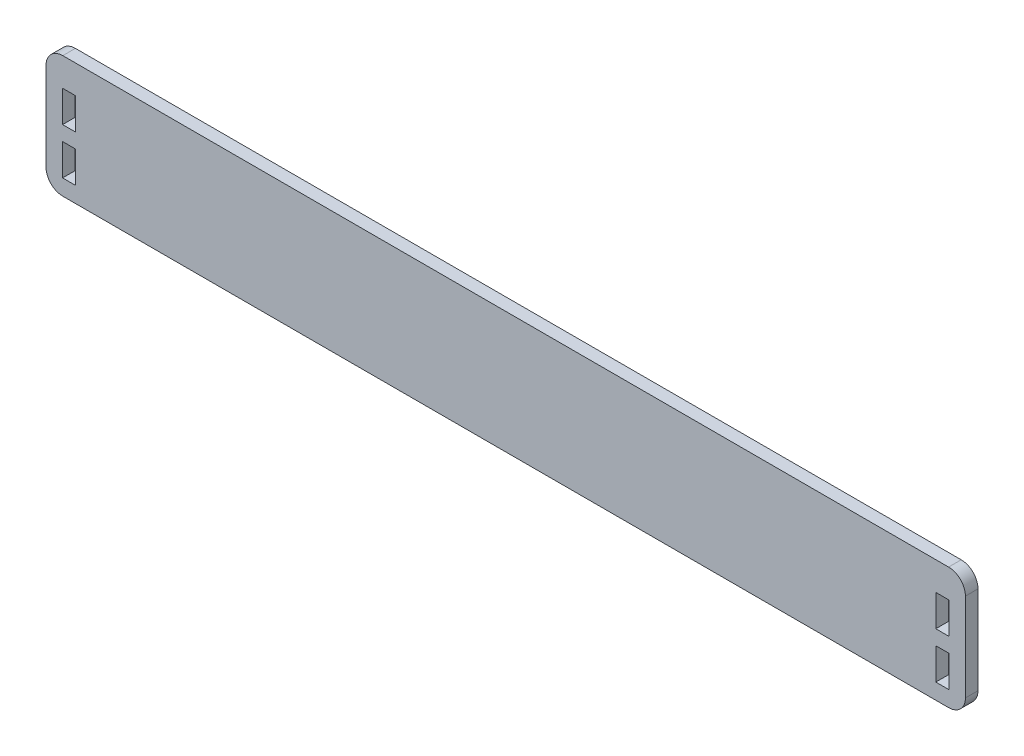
ISO-10303-21;
HEADER;
FILE_DESCRIPTION(('STEP AP214'),'2;1');
FILE_NAME('part.step','',(''),(''),'','','');
FILE_SCHEMA(('AUTOMOTIVE_DESIGN { 1 0 10303 214 1 1 1 1 }'));
ENDSEC;
DATA;
#1=APPLICATION_CONTEXT('core data for automotive mechanical design processes');
#2=APPLICATION_PROTOCOL_DEFINITION('international standard','automotive_design',2000,#1);
#3=PRODUCT_CONTEXT('',#1,'mechanical');
#4=PRODUCT('Part','Part','',(#3));
#5=PRODUCT_RELATED_PRODUCT_CATEGORY('part','',(#4));
#6=PRODUCT_DEFINITION_FORMATION('','',#4);
#7=PRODUCT_DEFINITION_CONTEXT('part definition',#1,'design');
#8=PRODUCT_DEFINITION('design','',#6,#7);
#9=PRODUCT_DEFINITION_SHAPE('','',#8);
#10=(LENGTH_UNIT() NAMED_UNIT(*) SI_UNIT(.MILLI.,.METRE.));
#11=(NAMED_UNIT(*) PLANE_ANGLE_UNIT() SI_UNIT($,.RADIAN.));
#12=(NAMED_UNIT(*) SI_UNIT($,.STERADIAN.) SOLID_ANGLE_UNIT());
#13=UNCERTAINTY_MEASURE_WITH_UNIT(LENGTH_MEASURE(1.E-05),#10,'distance_accuracy_value','');
#14=(GEOMETRIC_REPRESENTATION_CONTEXT(3) GLOBAL_UNCERTAINTY_ASSIGNED_CONTEXT((#13)) GLOBAL_UNIT_ASSIGNED_CONTEXT((#10,
#11,#12)) REPRESENTATION_CONTEXT('',''));
#15=CARTESIAN_POINT('',(0.,0.,0.));
#16=DIRECTION('',(0.,0.,1.));
#17=DIRECTION('',(1.,0.,0.));
#18=AXIS2_PLACEMENT_3D('',#15,#16,#17);
#19=CARTESIAN_POINT('',(-14.,66.0000000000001,6.));
#20=DIRECTION('',(1.,0.,0.));
#21=DIRECTION('',(0.,1.,0.));
#22=AXIS2_PLACEMENT_3D('',#19,#20,#21);
#23=PLANE('',#22);
#24=DIRECTION('',(0.,-1.,0.));
#25=VECTOR('',#24,1.);
#26=CARTESIAN_POINT('',(-14.,66.0000000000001,0.));
#27=LINE('',#26,#25);
#28=CARTESIAN_POINT('',(-14.,58.0000000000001,0.));
#29=VERTEX_POINT('',#28);
#30=CARTESIAN_POINT('',(-14.,16.,0.));
#31=VERTEX_POINT('',#30);
#32=EDGE_CURVE('E330',#29,#31,#27,.T.);
#33=ORIENTED_EDGE('',*,*,#32,.T.);
#34=DIRECTION('',(0.,0.,-1.));
#35=VECTOR('',#34,1.);
#36=CARTESIAN_POINT('',(-14.,16.,6.));
#37=LINE('',#36,#35);
#38=CARTESIAN_POINT('',(-14.,16.,6.));
#39=VERTEX_POINT('',#38);
#40=EDGE_CURVE('E11',#31,#39,#37,.F.);
#41=ORIENTED_EDGE('',*,*,#40,.T.);
#42=DIRECTION('',(0.,-1.,0.));
#43=VECTOR('',#42,1.);
#44=CARTESIAN_POINT('',(-14.,66.0000000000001,6.));
#45=LINE('',#44,#43);
#46=CARTESIAN_POINT('',(-14.,58.0000000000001,6.));
#47=VERTEX_POINT('',#46);
#48=EDGE_CURVE('E337',#47,#39,#45,.T.);
#49=ORIENTED_EDGE('',*,*,#48,.F.);
#50=DIRECTION('',(0.,0.,-1.));
#51=VECTOR('',#50,1.);
#52=CARTESIAN_POINT('',(-14.,58.0000000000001,6.));
#53=LINE('',#52,#51);
#54=EDGE_CURVE('E43',#47,#29,#53,.T.);
#55=ORIENTED_EDGE('',*,*,#54,.T.);
#56=EDGE_LOOP('',(#33,#41,#49,#55));
#57=FACE_BOUND('',#56,.T.);
#58=ADVANCED_FACE('F35',(#57),#23,.F.);
#59=CARTESIAN_POINT('',(-14.,8.00000000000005,6.));
#60=DIRECTION('',(0.,1.,0.));
#61=DIRECTION('',(0.,0.,1.));
#62=AXIS2_PLACEMENT_3D('',#59,#60,#61);
#63=PLANE('',#62);
#64=DIRECTION('',(1.,0.,0.));
#65=VECTOR('',#64,1.);
#66=CARTESIAN_POINT('',(-14.,8.00000000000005,0.));
#67=LINE('',#66,#65);
#68=CARTESIAN_POINT('',(-6.,8.00000000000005,0.));
#69=VERTEX_POINT('',#68);
#70=CARTESIAN_POINT('',(416.,8.00000000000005,0.));
#71=VERTEX_POINT('',#70);
#72=EDGE_CURVE('E351',#69,#71,#67,.T.);
#73=ORIENTED_EDGE('',*,*,#72,.T.);
#74=DIRECTION('',(0.,0.,-1.));
#75=VECTOR('',#74,1.);
#76=CARTESIAN_POINT('',(416.,8.00000000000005,6.));
#77=LINE('',#76,#75);
#78=CARTESIAN_POINT('',(416.,8.00000000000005,6.));
#79=VERTEX_POINT('',#78);
#80=EDGE_CURVE('E373',#71,#79,#77,.F.);
#81=ORIENTED_EDGE('',*,*,#80,.T.);
#82=DIRECTION('',(1.,0.,0.));
#83=VECTOR('',#82,1.);
#84=CARTESIAN_POINT('',(-14.,8.00000000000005,6.));
#85=LINE('',#84,#83);
#86=CARTESIAN_POINT('',(-6.,8.00000000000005,6.));
#87=VERTEX_POINT('',#86);
#88=EDGE_CURVE('E340',#87,#79,#85,.T.);
#89=ORIENTED_EDGE('',*,*,#88,.F.);
#90=DIRECTION('',(0.,0.,-1.));
#91=VECTOR('',#90,1.);
#92=CARTESIAN_POINT('',(-6.,8.00000000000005,6.));
#93=LINE('',#92,#91);
#94=EDGE_CURVE('E370',#87,#69,#93,.T.);
#95=ORIENTED_EDGE('',*,*,#94,.T.);
#96=EDGE_LOOP('',(#73,#81,#89,#95));
#97=FACE_BOUND('',#96,.T.);
#98=ADVANCED_FACE('F403',(#97),#63,.F.);
#99=CARTESIAN_POINT('',(424.,66.0000000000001,6.));
#100=DIRECTION('',(-1.,0.,0.));
#101=DIRECTION('',(0.,0.,1.));
#102=AXIS2_PLACEMENT_3D('',#99,#100,#101);
#103=PLANE('',#102);
#104=DIRECTION('',(0.,1.,0.));
#105=VECTOR('',#104,1.);
#106=CARTESIAN_POINT('',(424.,66.0000000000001,6.));
#107=LINE('',#106,#105);
#108=CARTESIAN_POINT('',(424.,16.,6.));
#109=VERTEX_POINT('',#108);
#110=CARTESIAN_POINT('',(424.,58.0000000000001,6.));
#111=VERTEX_POINT('',#110);
#112=EDGE_CURVE('E344',#109,#111,#107,.T.);
#113=ORIENTED_EDGE('',*,*,#112,.F.);
#114=DIRECTION('',(0.,0.,-1.));
#115=VECTOR('',#114,1.);
#116=CARTESIAN_POINT('',(424.,16.,6.));
#117=LINE('',#116,#115);
#118=CARTESIAN_POINT('',(424.,16.,0.));
#119=VERTEX_POINT('',#118);
#120=EDGE_CURVE('E359',#109,#119,#117,.T.);
#121=ORIENTED_EDGE('',*,*,#120,.T.);
#122=DIRECTION('',(0.,1.,0.));
#123=VECTOR('',#122,1.);
#124=CARTESIAN_POINT('',(424.,66.0000000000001,0.));
#125=LINE('',#124,#123);
#126=CARTESIAN_POINT('',(424.,58.0000000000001,0.));
#127=VERTEX_POINT('',#126);
#128=EDGE_CURVE('E354',#119,#127,#125,.T.);
#129=ORIENTED_EDGE('',*,*,#128,.T.);
#130=DIRECTION('',(0.,0.,-1.));
#131=VECTOR('',#130,1.);
#132=CARTESIAN_POINT('',(424.,58.0000000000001,6.));
#133=LINE('',#132,#131);
#134=EDGE_CURVE('E348',#127,#111,#133,.F.);
#135=ORIENTED_EDGE('',*,*,#134,.T.);
#136=EDGE_LOOP('',(#113,#121,#129,#135));
#137=FACE_BOUND('',#136,.T.);
#138=ADVANCED_FACE('F412',(#137),#103,.F.);
#139=CARTESIAN_POINT('',(-14.,66.0000000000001,6.));
#140=DIRECTION('',(0.,-1.,0.));
#141=DIRECTION('',(0.,0.,-1.));
#142=AXIS2_PLACEMENT_3D('',#139,#140,#141);
#143=PLANE('',#142);
#144=DIRECTION('',(-1.,0.,0.));
#145=VECTOR('',#144,1.);
#146=CARTESIAN_POINT('',(-14.,66.0000000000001,6.));
#147=LINE('',#146,#145);
#148=CARTESIAN_POINT('',(416.,66.0000000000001,6.));
#149=VERTEX_POINT('',#148);
#150=CARTESIAN_POINT('',(-6.00000000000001,66.0000000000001,6.));
#151=VERTEX_POINT('',#150);
#152=EDGE_CURVE('E346',#149,#151,#147,.T.);
#153=ORIENTED_EDGE('',*,*,#152,.F.);
#154=DIRECTION('',(0.,0.,-1.));
#155=VECTOR('',#154,1.);
#156=CARTESIAN_POINT('',(416.,66.0000000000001,6.));
#157=LINE('',#156,#155);
#158=CARTESIAN_POINT('',(416.,66.0000000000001,0.));
#159=VERTEX_POINT('',#158);
#160=EDGE_CURVE('E383',#149,#159,#157,.T.);
#161=ORIENTED_EDGE('',*,*,#160,.T.);
#162=DIRECTION('',(-1.,0.,0.));
#163=VECTOR('',#162,1.);
#164=CARTESIAN_POINT('',(-14.,66.0000000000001,0.));
#165=LINE('',#164,#163);
#166=CARTESIAN_POINT('',(-6.00000000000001,66.0000000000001,0.));
#167=VERTEX_POINT('',#166);
#168=EDGE_CURVE('E341',#159,#167,#165,.T.);
#169=ORIENTED_EDGE('',*,*,#168,.T.);
#170=DIRECTION('',(0.,0.,-1.));
#171=VECTOR('',#170,1.);
#172=CARTESIAN_POINT('',(-6.00000000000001,66.0000000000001,6.));
#173=LINE('',#172,#171);
#174=EDGE_CURVE('E50',#167,#151,#173,.F.);
#175=ORIENTED_EDGE('',*,*,#174,.T.);
#176=EDGE_LOOP('',(#153,#161,#169,#175));
#177=FACE_BOUND('',#176,.T.);
#178=ADVANCED_FACE('F417',(#177),#143,.F.);
#179=CARTESIAN_POINT('',(0.,0.,6.));
#180=DIRECTION('',(0.,0.,1.));
#181=DIRECTION('',(1.,0.,0.));
#182=AXIS2_PLACEMENT_3D('',#179,#180,#181);
#183=PLANE('',#182);
#184=DIRECTION('',(1.,0.,0.));
#185=VECTOR('',#184,1.);
#186=CARTESIAN_POINT('',(-6.10000000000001,15.5,6.));
#187=LINE('',#186,#185);
#188=CARTESIAN_POINT('',(-6.10000000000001,15.5,6.));
#189=VERTEX_POINT('',#188);
#190=CARTESIAN_POINT('',(0.0999999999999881,15.5,6.));
#191=VERTEX_POINT('',#190);
#192=EDGE_CURVE('E255',#189,#191,#187,.T.);
#193=ORIENTED_EDGE('',*,*,#192,.F.);
#194=DIRECTION('',(0.,-1.,0.));
#195=VECTOR('',#194,1.);
#196=CARTESIAN_POINT('',(-6.10000000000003,30.5,6.));
#197=LINE('',#196,#195);
#198=CARTESIAN_POINT('',(-6.10000000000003,30.5,6.));
#199=VERTEX_POINT('',#198);
#200=EDGE_CURVE('E245',#199,#189,#197,.T.);
#201=ORIENTED_EDGE('',*,*,#200,.F.);
#202=DIRECTION('',(-1.,0.,0.));
#203=VECTOR('',#202,1.);
#204=CARTESIAN_POINT('',(0.0999999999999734,30.5,6.));
#205=LINE('',#204,#203);
#206=CARTESIAN_POINT('',(0.0999999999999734,30.5,6.));
#207=VERTEX_POINT('',#206);
#208=EDGE_CURVE('E261',#207,#199,#205,.T.);
#209=ORIENTED_EDGE('',*,*,#208,.F.);
#210=DIRECTION('',(0.,1.,0.));
#211=VECTOR('',#210,1.);
#212=CARTESIAN_POINT('',(0.0999999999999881,15.5,6.));
#213=LINE('',#212,#211);
#214=EDGE_CURVE('E257',#191,#207,#213,.T.);
#215=ORIENTED_EDGE('',*,*,#214,.F.);
#216=EDGE_LOOP('',(#193,#201,#209,#215));
#217=FACE_BOUND('',#216,.T.);
#218=DIRECTION('',(1.,0.,0.));
#219=VECTOR('',#218,1.);
#220=CARTESIAN_POINT('',(416.1,37.5000000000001,5.99999999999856));
#221=LINE('',#220,#219);
#222=CARTESIAN_POINT('',(409.9,37.5000000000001,5.99999999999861));
#223=VERTEX_POINT('',#222);
#224=CARTESIAN_POINT('',(416.1,37.5000000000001,6.));
#225=VERTEX_POINT('',#224);
#226=EDGE_CURVE('E237',#223,#225,#221,.T.);
#227=ORIENTED_EDGE('',*,*,#226,.F.);
#228=DIRECTION('',(0.,-1.,0.));
#229=VECTOR('',#228,1.);
#230=CARTESIAN_POINT('',(409.9,37.5000000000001,5.99999999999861));
#231=LINE('',#230,#229);
#232=CARTESIAN_POINT('',(409.9,52.5000000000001,5.99999999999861));
#233=VERTEX_POINT('',#232);
#234=EDGE_CURVE('E279',#233,#223,#231,.T.);
#235=ORIENTED_EDGE('',*,*,#234,.F.);
#236=DIRECTION('',(-1.,0.,0.));
#237=VECTOR('',#236,1.);
#238=CARTESIAN_POINT('',(409.9,52.5000000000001,5.99999999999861));
#239=LINE('',#238,#237);
#240=CARTESIAN_POINT('',(416.1,52.5000000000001,5.99999999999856));
#241=VERTEX_POINT('',#240);
#242=EDGE_CURVE('E293',#241,#233,#239,.T.);
#243=ORIENTED_EDGE('',*,*,#242,.F.);
#244=DIRECTION('',(0.,1.,0.));
#245=VECTOR('',#244,1.);
#246=CARTESIAN_POINT('',(416.1,52.5000000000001,5.99999999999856));
#247=LINE('',#246,#245);
#248=EDGE_CURVE('E290',#225,#241,#247,.T.);
#249=ORIENTED_EDGE('',*,*,#248,.F.);
#250=EDGE_LOOP('',(#227,#235,#243,#249));
#251=FACE_BOUND('',#250,.T.);
#252=DIRECTION('',(1.,0.,0.));
#253=VECTOR('',#252,1.);
#254=CARTESIAN_POINT('',(416.1,15.5000000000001,5.99999999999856));
#255=LINE('',#254,#253);
#256=CARTESIAN_POINT('',(409.9,15.5000000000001,5.99999999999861));
#257=VERTEX_POINT('',#256);
#258=CARTESIAN_POINT('',(416.1,15.5000000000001,6.));
#259=VERTEX_POINT('',#258);
#260=EDGE_CURVE('E204',#257,#259,#255,.T.);
#261=ORIENTED_EDGE('',*,*,#260,.F.);
#262=DIRECTION('',(0.,-1.,0.));
#263=VECTOR('',#262,1.);
#264=CARTESIAN_POINT('',(409.9,15.5000000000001,5.99999999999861));
#265=LINE('',#264,#263);
#266=CARTESIAN_POINT('',(409.9,30.5000000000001,5.99999999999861));
#267=VERTEX_POINT('',#266);
#268=EDGE_CURVE('E222',#267,#257,#265,.T.);
#269=ORIENTED_EDGE('',*,*,#268,.F.);
#270=DIRECTION('',(-1.,0.,0.));
#271=VECTOR('',#270,1.);
#272=CARTESIAN_POINT('',(409.9,30.5000000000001,5.99999999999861));
#273=LINE('',#272,#271);
#274=CARTESIAN_POINT('',(416.1,30.5000000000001,5.99999999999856));
#275=VERTEX_POINT('',#274);
#276=EDGE_CURVE('E225',#275,#267,#273,.T.);
#277=ORIENTED_EDGE('',*,*,#276,.F.);
#278=DIRECTION('',(0.,1.,0.));
#279=VECTOR('',#278,1.);
#280=CARTESIAN_POINT('',(416.1,30.5000000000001,5.99999999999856));
#281=LINE('',#280,#279);
#282=EDGE_CURVE('E231',#259,#275,#281,.T.);
#283=ORIENTED_EDGE('',*,*,#282,.F.);
#284=EDGE_LOOP('',(#261,#269,#277,#283));
#285=FACE_BOUND('',#284,.T.);
#286=DIRECTION('',(1.,0.,0.));
#287=VECTOR('',#286,1.);
#288=CARTESIAN_POINT('',(-6.10000000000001,37.5,6.));
#289=LINE('',#288,#287);
#290=CARTESIAN_POINT('',(-6.10000000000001,37.5,6.));
#291=VERTEX_POINT('',#290);
#292=CARTESIAN_POINT('',(0.0999999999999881,37.5,6.));
#293=VERTEX_POINT('',#292);
#294=EDGE_CURVE('E268',#291,#293,#289,.T.);
#295=ORIENTED_EDGE('',*,*,#294,.F.);
#296=DIRECTION('',(0.,-1.,0.));
#297=VECTOR('',#296,1.);
#298=CARTESIAN_POINT('',(-6.10000000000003,52.5,6.));
#299=LINE('',#298,#297);
#300=CARTESIAN_POINT('',(-6.10000000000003,52.5,6.));
#301=VERTEX_POINT('',#300);
#302=EDGE_CURVE('E309',#301,#291,#299,.T.);
#303=ORIENTED_EDGE('',*,*,#302,.F.);
#304=DIRECTION('',(-1.,0.,0.));
#305=VECTOR('',#304,1.);
#306=CARTESIAN_POINT('',(0.0999999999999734,52.5,6.));
#307=LINE('',#306,#305);
#308=CARTESIAN_POINT('',(0.0999999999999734,52.5,6.));
#309=VERTEX_POINT('',#308);
#310=EDGE_CURVE('E323',#309,#301,#307,.T.);
#311=ORIENTED_EDGE('',*,*,#310,.F.);
#312=DIRECTION('',(0.,1.,0.));
#313=VECTOR('',#312,1.);
#314=CARTESIAN_POINT('',(0.0999999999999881,37.5,6.));
#315=LINE('',#314,#313);
#316=EDGE_CURVE('E320',#293,#309,#315,.T.);
#317=ORIENTED_EDGE('',*,*,#316,.F.);
#318=EDGE_LOOP('',(#295,#303,#311,#317));
#319=FACE_BOUND('',#318,.T.);
#320=ORIENTED_EDGE('',*,*,#88,.T.);
#321=CARTESIAN_POINT('',(416.,16.,6.));
#322=DIRECTION('',(0.,0.,1.));
#323=DIRECTION('',(1.,0.,0.));
#324=AXIS2_PLACEMENT_3D('',#321,#322,#323);
#325=CIRCLE('',#324,8.);
#326=EDGE_CURVE('E380',#79,#109,#325,.T.);
#327=ORIENTED_EDGE('',*,*,#326,.T.);
#328=ORIENTED_EDGE('',*,*,#112,.T.);
#329=CARTESIAN_POINT('',(416.,58.0000000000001,6.));
#330=DIRECTION('',(0.,0.,1.));
#331=DIRECTION('',(1.,0.,0.));
#332=AXIS2_PLACEMENT_3D('',#329,#330,#331);
#333=CIRCLE('',#332,8.);
#334=EDGE_CURVE('E57',#111,#149,#333,.T.);
#335=ORIENTED_EDGE('',*,*,#334,.T.);
#336=ORIENTED_EDGE('',*,*,#152,.T.);
#337=CARTESIAN_POINT('',(-6.00000000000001,58.0000000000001,6.));
#338=DIRECTION('',(0.,0.,1.));
#339=DIRECTION('',(1.,0.,0.));
#340=AXIS2_PLACEMENT_3D('',#337,#338,#339);
#341=CIRCLE('',#340,8.);
#342=EDGE_CURVE('E375',#151,#47,#341,.T.);
#343=ORIENTED_EDGE('',*,*,#342,.T.);
#344=ORIENTED_EDGE('',*,*,#48,.T.);
#345=CARTESIAN_POINT('',(-6.,16.,6.));
#346=DIRECTION('',(0.,0.,1.));
#347=DIRECTION('',(1.,0.,0.));
#348=AXIS2_PLACEMENT_3D('',#345,#346,#347);
#349=CIRCLE('',#348,8.);
#350=EDGE_CURVE('E377',#39,#87,#349,.T.);
#351=ORIENTED_EDGE('',*,*,#350,.T.);
#352=EDGE_LOOP('',(#320,#327,#328,#335,#336,#343,#344,#351));
#353=FACE_BOUND('',#352,.T.);
#354=ADVANCED_FACE('F406',(#217,#251,#285,#319,#353),#183,.T.);
#355=CARTESIAN_POINT('',(0.,0.,0.));
#356=DIRECTION('',(0.,0.,1.));
#357=DIRECTION('',(1.,0.,0.));
#358=AXIS2_PLACEMENT_3D('',#355,#356,#357);
#359=PLANE('',#358);
#360=DIRECTION('',(0.,-1.,0.));
#361=VECTOR('',#360,1.);
#362=CARTESIAN_POINT('',(-6.10000000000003,30.5,0.));
#363=LINE('',#362,#361);
#364=CARTESIAN_POINT('',(-6.10000000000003,30.5,0.));
#365=VERTEX_POINT('',#364);
#366=CARTESIAN_POINT('',(-6.10000000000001,15.5,0.));
#367=VERTEX_POINT('',#366);
#368=EDGE_CURVE('E251',#365,#367,#363,.T.);
#369=ORIENTED_EDGE('',*,*,#368,.T.);
#370=DIRECTION('',(1.,0.,0.));
#371=VECTOR('',#370,1.);
#372=CARTESIAN_POINT('',(-6.10000000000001,15.5,0.));
#373=LINE('',#372,#371);
#374=CARTESIAN_POINT('',(0.0999999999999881,15.5,0.));
#375=VERTEX_POINT('',#374);
#376=EDGE_CURVE('E241',#367,#375,#373,.T.);
#377=ORIENTED_EDGE('',*,*,#376,.T.);
#378=DIRECTION('',(0.,1.,0.));
#379=VECTOR('',#378,1.);
#380=CARTESIAN_POINT('',(0.0999999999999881,15.5,0.));
#381=LINE('',#380,#379);
#382=CARTESIAN_POINT('',(0.0999999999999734,30.5,0.));
#383=VERTEX_POINT('',#382);
#384=EDGE_CURVE('E244',#375,#383,#381,.T.);
#385=ORIENTED_EDGE('',*,*,#384,.T.);
#386=DIRECTION('',(-1.,0.,0.));
#387=VECTOR('',#386,1.);
#388=CARTESIAN_POINT('',(0.0999999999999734,30.5,0.));
#389=LINE('',#388,#387);
#390=EDGE_CURVE('E248',#383,#365,#389,.T.);
#391=ORIENTED_EDGE('',*,*,#390,.T.);
#392=EDGE_LOOP('',(#369,#377,#385,#391));
#393=FACE_BOUND('',#392,.T.);
#394=DIRECTION('',(0.,-1.,0.));
#395=VECTOR('',#394,1.);
#396=CARTESIAN_POINT('',(409.9,37.5000000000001,-1.39211558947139E-12));
#397=LINE('',#396,#395);
#398=CARTESIAN_POINT('',(409.9,52.5000000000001,-1.39211558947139E-12));
#399=VERTEX_POINT('',#398);
#400=CARTESIAN_POINT('',(409.9,37.5000000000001,-1.39211558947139E-12));
#401=VERTEX_POINT('',#400);
#402=EDGE_CURVE('E285',#399,#401,#397,.T.);
#403=ORIENTED_EDGE('',*,*,#402,.T.);
#404=DIRECTION('',(1.,0.,0.));
#405=VECTOR('',#404,1.);
#406=CARTESIAN_POINT('',(416.1,37.5000000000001,-1.43548367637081E-12));
#407=LINE('',#406,#405);
#408=CARTESIAN_POINT('',(416.1,37.5000000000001,-1.43548367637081E-12));
#409=VERTEX_POINT('',#408);
#410=EDGE_CURVE('E275',#401,#409,#407,.T.);
#411=ORIENTED_EDGE('',*,*,#410,.T.);
#412=DIRECTION('',(0.,1.,0.));
#413=VECTOR('',#412,1.);
#414=CARTESIAN_POINT('',(416.1,52.5000000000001,-1.43548367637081E-12));
#415=LINE('',#414,#413);
#416=CARTESIAN_POINT('',(416.1,52.5000000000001,0.));
#417=VERTEX_POINT('',#416);
#418=EDGE_CURVE('E278',#409,#417,#415,.T.);
#419=ORIENTED_EDGE('',*,*,#418,.T.);
#420=DIRECTION('',(-1.,0.,0.));
#421=VECTOR('',#420,1.);
#422=CARTESIAN_POINT('',(409.9,52.5000000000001,-1.39211558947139E-12));
#423=LINE('',#422,#421);
#424=EDGE_CURVE('E282',#417,#399,#423,.T.);
#425=ORIENTED_EDGE('',*,*,#424,.T.);
#426=EDGE_LOOP('',(#403,#411,#419,#425));
#427=FACE_BOUND('',#426,.T.);
#428=DIRECTION('',(0.,-1.,0.));
#429=VECTOR('',#428,1.);
#430=CARTESIAN_POINT('',(409.9,15.5000000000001,-1.39211558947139E-12));
#431=LINE('',#430,#429);
#432=CARTESIAN_POINT('',(409.9,30.5000000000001,-1.39211558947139E-12));
#433=VERTEX_POINT('',#432);
#434=CARTESIAN_POINT('',(409.9,15.5000000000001,-1.39211558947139E-12));
#435=VERTEX_POINT('',#434);
#436=EDGE_CURVE('E209',#433,#435,#431,.T.);
#437=ORIENTED_EDGE('',*,*,#436,.T.);
#438=DIRECTION('',(1.,0.,0.));
#439=VECTOR('',#438,1.);
#440=CARTESIAN_POINT('',(416.1,15.5000000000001,-1.43548367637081E-12));
#441=LINE('',#440,#439);
#442=CARTESIAN_POINT('',(416.1,15.5000000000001,-1.43548367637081E-12));
#443=VERTEX_POINT('',#442);
#444=EDGE_CURVE('E201',#435,#443,#441,.T.);
#445=ORIENTED_EDGE('',*,*,#444,.T.);
#446=DIRECTION('',(0.,1.,0.));
#447=VECTOR('',#446,1.);
#448=CARTESIAN_POINT('',(416.1,30.5000000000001,-1.43548367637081E-12));
#449=LINE('',#448,#447);
#450=CARTESIAN_POINT('',(416.1,30.5000000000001,0.));
#451=VERTEX_POINT('',#450);
#452=EDGE_CURVE('E213',#443,#451,#449,.T.);
#453=ORIENTED_EDGE('',*,*,#452,.T.);
#454=DIRECTION('',(-1.,0.,0.));
#455=VECTOR('',#454,1.);
#456=CARTESIAN_POINT('',(409.9,30.5000000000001,-1.39211558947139E-12));
#457=LINE('',#456,#455);
#458=EDGE_CURVE('E217',#451,#433,#457,.T.);
#459=ORIENTED_EDGE('',*,*,#458,.T.);
#460=EDGE_LOOP('',(#437,#445,#453,#459));
#461=FACE_BOUND('',#460,.T.);
#462=DIRECTION('',(0.,-1.,0.));
#463=VECTOR('',#462,1.);
#464=CARTESIAN_POINT('',(-6.10000000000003,52.5,0.));
#465=LINE('',#464,#463);
#466=CARTESIAN_POINT('',(-6.10000000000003,52.5,0.));
#467=VERTEX_POINT('',#466);
#468=CARTESIAN_POINT('',(-6.10000000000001,37.5,0.));
#469=VERTEX_POINT('',#468);
#470=EDGE_CURVE('E315',#467,#469,#465,.T.);
#471=ORIENTED_EDGE('',*,*,#470,.T.);
#472=DIRECTION('',(1.,0.,0.));
#473=VECTOR('',#472,1.);
#474=CARTESIAN_POINT('',(-6.10000000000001,37.5,0.));
#475=LINE('',#474,#473);
#476=CARTESIAN_POINT('',(0.0999999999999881,37.5,0.));
#477=VERTEX_POINT('',#476);
#478=EDGE_CURVE('E305',#469,#477,#475,.T.);
#479=ORIENTED_EDGE('',*,*,#478,.T.);
#480=DIRECTION('',(0.,1.,0.));
#481=VECTOR('',#480,1.);
#482=CARTESIAN_POINT('',(0.0999999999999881,37.5,0.));
#483=LINE('',#482,#481);
#484=CARTESIAN_POINT('',(0.0999999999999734,52.5,0.));
#485=VERTEX_POINT('',#484);
#486=EDGE_CURVE('E308',#477,#485,#483,.T.);
#487=ORIENTED_EDGE('',*,*,#486,.T.);
#488=DIRECTION('',(-1.,0.,0.));
#489=VECTOR('',#488,1.);
#490=CARTESIAN_POINT('',(0.0999999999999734,52.5,0.));
#491=LINE('',#490,#489);
#492=EDGE_CURVE('E312',#485,#467,#491,.T.);
#493=ORIENTED_EDGE('',*,*,#492,.T.);
#494=EDGE_LOOP('',(#471,#479,#487,#493));
#495=FACE_BOUND('',#494,.T.);
#496=ORIENTED_EDGE('',*,*,#128,.F.);
#497=CARTESIAN_POINT('',(416.,16.,0.));
#498=DIRECTION('',(0.,0.,1.));
#499=DIRECTION('',(1.,0.,0.));
#500=AXIS2_PLACEMENT_3D('',#497,#498,#499);
#501=CIRCLE('',#500,8.);
#502=EDGE_CURVE('E368',#119,#71,#501,.F.);
#503=ORIENTED_EDGE('',*,*,#502,.T.);
#504=ORIENTED_EDGE('',*,*,#72,.F.);
#505=CARTESIAN_POINT('',(-6.,16.,0.));
#506=DIRECTION('',(0.,0.,1.));
#507=DIRECTION('',(1.,0.,0.));
#508=AXIS2_PLACEMENT_3D('',#505,#506,#507);
#509=CIRCLE('',#508,8.);
#510=EDGE_CURVE('E364',#69,#31,#509,.F.);
#511=ORIENTED_EDGE('',*,*,#510,.T.);
#512=ORIENTED_EDGE('',*,*,#32,.F.);
#513=CARTESIAN_POINT('',(-6.00000000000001,58.0000000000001,0.));
#514=DIRECTION('',(0.,0.,1.));
#515=DIRECTION('',(1.,0.,0.));
#516=AXIS2_PLACEMENT_3D('',#513,#514,#515);
#517=CIRCLE('',#516,8.);
#518=EDGE_CURVE('E362',#29,#167,#517,.F.);
#519=ORIENTED_EDGE('',*,*,#518,.T.);
#520=ORIENTED_EDGE('',*,*,#168,.F.);
#521=CARTESIAN_POINT('',(416.,58.0000000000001,0.));
#522=DIRECTION('',(0.,0.,1.));
#523=DIRECTION('',(1.,0.,0.));
#524=AXIS2_PLACEMENT_3D('',#521,#522,#523);
#525=CIRCLE('',#524,8.);
#526=EDGE_CURVE('E366',#159,#127,#525,.F.);
#527=ORIENTED_EDGE('',*,*,#526,.T.);
#528=EDGE_LOOP('',(#496,#503,#504,#511,#512,#519,#520,#527));
#529=FACE_BOUND('',#528,.T.);
#530=ADVANCED_FACE('F219',(#393,#427,#461,#495,#529),#359,.F.);
#531=CARTESIAN_POINT('',(-6.10000000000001,37.5,0.));
#532=DIRECTION('',(0.,-1.,0.));
#533=DIRECTION('',(0.,0.,-1.));
#534=AXIS2_PLACEMENT_3D('',#531,#532,#533);
#535=PLANE('',#534);
#536=ORIENTED_EDGE('',*,*,#294,.T.);
#537=DIRECTION('',(0.,0.,1.));
#538=VECTOR('',#537,1.);
#539=CARTESIAN_POINT('',(0.0999999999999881,37.5,0.));
#540=LINE('',#539,#538);
#541=EDGE_CURVE('E318',#477,#293,#540,.T.);
#542=ORIENTED_EDGE('',*,*,#541,.F.);
#543=ORIENTED_EDGE('',*,*,#478,.F.);
#544=DIRECTION('',(0.,0.,1.));
#545=VECTOR('',#544,1.);
#546=CARTESIAN_POINT('',(-6.10000000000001,37.5,0.));
#547=LINE('',#546,#545);
#548=EDGE_CURVE('E328',#469,#291,#547,.T.);
#549=ORIENTED_EDGE('',*,*,#548,.T.);
#550=EDGE_LOOP('',(#536,#542,#543,#549));
#551=FACE_BOUND('',#550,.T.);
#552=ADVANCED_FACE('F585',(#551),#535,.F.);
#553=CARTESIAN_POINT('',(-6.10000000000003,52.5,0.));
#554=DIRECTION('',(-1.,0.,0.));
#555=DIRECTION('',(0.,-1.,0.));
#556=AXIS2_PLACEMENT_3D('',#553,#554,#555);
#557=PLANE('',#556);
#558=ORIENTED_EDGE('',*,*,#302,.T.);
#559=ORIENTED_EDGE('',*,*,#548,.F.);
#560=ORIENTED_EDGE('',*,*,#470,.F.);
#561=DIRECTION('',(0.,0.,1.));
#562=VECTOR('',#561,1.);
#563=CARTESIAN_POINT('',(-6.10000000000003,52.5,0.));
#564=LINE('',#563,#562);
#565=EDGE_CURVE('E331',#467,#301,#564,.T.);
#566=ORIENTED_EDGE('',*,*,#565,.T.);
#567=EDGE_LOOP('',(#558,#559,#560,#566));
#568=FACE_BOUND('',#567,.T.);
#569=ADVANCED_FACE('F576',(#568),#557,.F.);
#570=CARTESIAN_POINT('',(0.0999999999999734,52.5,0.));
#571=DIRECTION('',(0.,1.,0.));
#572=DIRECTION('',(0.,0.,1.));
#573=AXIS2_PLACEMENT_3D('',#570,#571,#572);
#574=PLANE('',#573);
#575=ORIENTED_EDGE('',*,*,#310,.T.);
#576=ORIENTED_EDGE('',*,*,#565,.F.);
#577=ORIENTED_EDGE('',*,*,#492,.F.);
#578=DIRECTION('',(0.,0.,1.));
#579=VECTOR('',#578,1.);
#580=CARTESIAN_POINT('',(0.0999999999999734,52.5,0.));
#581=LINE('',#580,#579);
#582=EDGE_CURVE('E333',#485,#309,#581,.T.);
#583=ORIENTED_EDGE('',*,*,#582,.T.);
#584=EDGE_LOOP('',(#575,#576,#577,#583));
#585=FACE_BOUND('',#584,.T.);
#586=ADVANCED_FACE('F567',(#585),#574,.F.);
#587=CARTESIAN_POINT('',(0.0999999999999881,37.5,0.));
#588=DIRECTION('',(1.,0.,0.));
#589=DIRECTION('',(0.,1.,0.));
#590=AXIS2_PLACEMENT_3D('',#587,#588,#589);
#591=PLANE('',#590);
#592=ORIENTED_EDGE('',*,*,#316,.T.);
#593=ORIENTED_EDGE('',*,*,#582,.F.);
#594=ORIENTED_EDGE('',*,*,#486,.F.);
#595=ORIENTED_EDGE('',*,*,#541,.T.);
#596=EDGE_LOOP('',(#592,#593,#594,#595));
#597=FACE_BOUND('',#596,.T.);
#598=ADVANCED_FACE('F559',(#597),#591,.F.);
#599=CARTESIAN_POINT('',(416.1,15.5000000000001,-1.43548367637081E-12));
#600=DIRECTION('',(0.,-1.,0.));
#601=DIRECTION('',(0.,0.,-1.));
#602=AXIS2_PLACEMENT_3D('',#599,#600,#601);
#603=PLANE('',#602);
#604=ORIENTED_EDGE('',*,*,#260,.T.);
#605=DIRECTION('',(0.,0.,1.));
#606=VECTOR('',#605,1.);
#607=CARTESIAN_POINT('',(416.1,15.5000000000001,-1.43548367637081E-12));
#608=LINE('',#607,#606);
#609=EDGE_CURVE('E197',#443,#259,#608,.T.);
#610=ORIENTED_EDGE('',*,*,#609,.F.);
#611=ORIENTED_EDGE('',*,*,#444,.F.);
#612=DIRECTION('',(0.,0.,1.));
#613=VECTOR('',#612,1.);
#614=CARTESIAN_POINT('',(409.9,15.5000000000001,-1.39211558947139E-12));
#615=LINE('',#614,#613);
#616=EDGE_CURVE('E235',#435,#257,#615,.T.);
#617=ORIENTED_EDGE('',*,*,#616,.T.);
#618=EDGE_LOOP('',(#604,#610,#611,#617));
#619=FACE_BOUND('',#618,.T.);
#620=ADVANCED_FACE('F199',(#619),#603,.F.);
#621=CARTESIAN_POINT('',(409.9,15.5000000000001,-1.39211558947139E-12));
#622=DIRECTION('',(-1.,0.,0.));
#623=DIRECTION('',(0.,0.,1.));
#624=AXIS2_PLACEMENT_3D('',#621,#622,#623);
#625=PLANE('',#624);
#626=ORIENTED_EDGE('',*,*,#268,.T.);
#627=ORIENTED_EDGE('',*,*,#616,.F.);
#628=ORIENTED_EDGE('',*,*,#436,.F.);
#629=DIRECTION('',(0.,0.,1.));
#630=VECTOR('',#629,1.);
#631=CARTESIAN_POINT('',(409.9,30.5000000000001,-1.39211558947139E-12));
#632=LINE('',#631,#630);
#633=EDGE_CURVE('E238',#433,#267,#632,.T.);
#634=ORIENTED_EDGE('',*,*,#633,.T.);
#635=EDGE_LOOP('',(#626,#627,#628,#634));
#636=FACE_BOUND('',#635,.T.);
#637=ADVANCED_FACE('F542',(#636),#625,.F.);
#638=CARTESIAN_POINT('',(409.9,30.5000000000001,-1.39211558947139E-12));
#639=DIRECTION('',(0.,1.,0.));
#640=DIRECTION('',(0.,0.,1.));
#641=AXIS2_PLACEMENT_3D('',#638,#639,#640);
#642=PLANE('',#641);
#643=ORIENTED_EDGE('',*,*,#276,.T.);
#644=ORIENTED_EDGE('',*,*,#633,.F.);
#645=ORIENTED_EDGE('',*,*,#458,.F.);
#646=DIRECTION('',(0.,0.,1.));
#647=VECTOR('',#646,1.);
#648=CARTESIAN_POINT('',(416.1,30.5000000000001,-1.43548367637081E-12));
#649=LINE('',#648,#647);
#650=EDGE_CURVE('E208',#451,#275,#649,.T.);
#651=ORIENTED_EDGE('',*,*,#650,.T.);
#652=EDGE_LOOP('',(#643,#644,#645,#651));
#653=FACE_BOUND('',#652,.T.);
#654=ADVANCED_FACE('F534',(#653),#642,.F.);
#655=CARTESIAN_POINT('',(416.1,30.5000000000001,-1.43548367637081E-12));
#656=DIRECTION('',(1.,0.,0.));
#657=DIRECTION('',(0.,0.,-1.));
#658=AXIS2_PLACEMENT_3D('',#655,#656,#657);
#659=PLANE('',#658);
#660=ORIENTED_EDGE('',*,*,#282,.T.);
#661=ORIENTED_EDGE('',*,*,#650,.F.);
#662=ORIENTED_EDGE('',*,*,#452,.F.);
#663=ORIENTED_EDGE('',*,*,#609,.T.);
#664=EDGE_LOOP('',(#660,#661,#662,#663));
#665=FACE_BOUND('',#664,.T.);
#666=ADVANCED_FACE('F214',(#665),#659,.F.);
#667=CARTESIAN_POINT('',(416.1,37.5000000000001,-1.43548367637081E-12));
#668=DIRECTION('',(0.,-1.,0.));
#669=DIRECTION('',(0.,0.,-1.));
#670=AXIS2_PLACEMENT_3D('',#667,#668,#669);
#671=PLANE('',#670);
#672=ORIENTED_EDGE('',*,*,#226,.T.);
#673=DIRECTION('',(0.,0.,1.));
#674=VECTOR('',#673,1.);
#675=CARTESIAN_POINT('',(416.1,37.5000000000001,-1.43548367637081E-12));
#676=LINE('',#675,#674);
#677=EDGE_CURVE('E288',#409,#225,#676,.T.);
#678=ORIENTED_EDGE('',*,*,#677,.F.);
#679=ORIENTED_EDGE('',*,*,#410,.F.);
#680=DIRECTION('',(0.,0.,1.));
#681=VECTOR('',#680,1.);
#682=CARTESIAN_POINT('',(409.9,37.5000000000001,-1.39211558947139E-12));
#683=LINE('',#682,#681);
#684=EDGE_CURVE('E258',#401,#223,#683,.T.);
#685=ORIENTED_EDGE('',*,*,#684,.T.);
#686=EDGE_LOOP('',(#672,#678,#679,#685));
#687=FACE_BOUND('',#686,.T.);
#688=ADVANCED_FACE('F517',(#687),#671,.F.);
#689=CARTESIAN_POINT('',(409.9,37.5000000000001,-1.39211558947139E-12));
#690=DIRECTION('',(-1.,0.,0.));
#691=DIRECTION('',(0.,0.,1.));
#692=AXIS2_PLACEMENT_3D('',#689,#690,#691);
#693=PLANE('',#692);
#694=ORIENTED_EDGE('',*,*,#234,.T.);
#695=ORIENTED_EDGE('',*,*,#684,.F.);
#696=ORIENTED_EDGE('',*,*,#402,.F.);
#697=DIRECTION('',(0.,0.,1.));
#698=VECTOR('',#697,1.);
#699=CARTESIAN_POINT('',(409.9,52.5000000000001,-1.39211558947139E-12));
#700=LINE('',#699,#698);
#701=EDGE_CURVE('E299',#399,#233,#700,.T.);
#702=ORIENTED_EDGE('',*,*,#701,.T.);
#703=EDGE_LOOP('',(#694,#695,#696,#702));
#704=FACE_BOUND('',#703,.T.);
#705=ADVANCED_FACE('F508',(#704),#693,.F.);
#706=CARTESIAN_POINT('',(409.9,52.5000000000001,-1.39211558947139E-12));
#707=DIRECTION('',(0.,1.,0.));
#708=DIRECTION('',(0.,0.,1.));
#709=AXIS2_PLACEMENT_3D('',#706,#707,#708);
#710=PLANE('',#709);
#711=ORIENTED_EDGE('',*,*,#242,.T.);
#712=ORIENTED_EDGE('',*,*,#701,.F.);
#713=ORIENTED_EDGE('',*,*,#424,.F.);
#714=DIRECTION('',(0.,0.,1.));
#715=VECTOR('',#714,1.);
#716=CARTESIAN_POINT('',(416.1,52.5000000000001,-1.43548367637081E-12));
#717=LINE('',#716,#715);
#718=EDGE_CURVE('E301',#417,#241,#717,.T.);
#719=ORIENTED_EDGE('',*,*,#718,.T.);
#720=EDGE_LOOP('',(#711,#712,#713,#719));
#721=FACE_BOUND('',#720,.T.);
#722=ADVANCED_FACE('F499',(#721),#710,.F.);
#723=CARTESIAN_POINT('',(416.1,52.5000000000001,-1.43548367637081E-12));
#724=DIRECTION('',(1.,0.,0.));
#725=DIRECTION('',(0.,0.,-1.));
#726=AXIS2_PLACEMENT_3D('',#723,#724,#725);
#727=PLANE('',#726);
#728=ORIENTED_EDGE('',*,*,#248,.T.);
#729=ORIENTED_EDGE('',*,*,#718,.F.);
#730=ORIENTED_EDGE('',*,*,#418,.F.);
#731=ORIENTED_EDGE('',*,*,#677,.T.);
#732=EDGE_LOOP('',(#728,#729,#730,#731));
#733=FACE_BOUND('',#732,.T.);
#734=ADVANCED_FACE('F490',(#733),#727,.F.);
#735=CARTESIAN_POINT('',(-6.10000000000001,15.5,0.));
#736=DIRECTION('',(0.,-1.,0.));
#737=DIRECTION('',(1.,0.,0.));
#738=AXIS2_PLACEMENT_3D('',#735,#736,#737);
#739=PLANE('',#738);
#740=ORIENTED_EDGE('',*,*,#192,.T.);
#741=DIRECTION('',(0.,0.,1.));
#742=VECTOR('',#741,1.);
#743=CARTESIAN_POINT('',(0.0999999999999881,15.5,0.));
#744=LINE('',#743,#742);
#745=EDGE_CURVE('E254',#375,#191,#744,.T.);
#746=ORIENTED_EDGE('',*,*,#745,.F.);
#747=ORIENTED_EDGE('',*,*,#376,.F.);
#748=DIRECTION('',(0.,0.,1.));
#749=VECTOR('',#748,1.);
#750=CARTESIAN_POINT('',(-6.10000000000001,15.5,0.));
#751=LINE('',#750,#749);
#752=EDGE_CURVE('E266',#367,#189,#751,.T.);
#753=ORIENTED_EDGE('',*,*,#752,.T.);
#754=EDGE_LOOP('',(#740,#746,#747,#753));
#755=FACE_BOUND('',#754,.T.);
#756=ADVANCED_FACE('F481',(#755),#739,.F.);
#757=CARTESIAN_POINT('',(-6.10000000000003,30.5,0.));
#758=DIRECTION('',(-1.,0.,0.));
#759=DIRECTION('',(0.,-1.,0.));
#760=AXIS2_PLACEMENT_3D('',#757,#758,#759);
#761=PLANE('',#760);
#762=ORIENTED_EDGE('',*,*,#200,.T.);
#763=ORIENTED_EDGE('',*,*,#752,.F.);
#764=ORIENTED_EDGE('',*,*,#368,.F.);
#765=DIRECTION('',(0.,0.,1.));
#766=VECTOR('',#765,1.);
#767=CARTESIAN_POINT('',(-6.10000000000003,30.5,0.));
#768=LINE('',#767,#766);
#769=EDGE_CURVE('E269',#365,#199,#768,.T.);
#770=ORIENTED_EDGE('',*,*,#769,.T.);
#771=EDGE_LOOP('',(#762,#763,#764,#770));
#772=FACE_BOUND('',#771,.T.);
#773=ADVANCED_FACE('F472',(#772),#761,.F.);
#774=CARTESIAN_POINT('',(0.0999999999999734,30.5,0.));
#775=DIRECTION('',(0.,1.,0.));
#776=DIRECTION('',(-1.,0.,0.));
#777=AXIS2_PLACEMENT_3D('',#774,#775,#776);
#778=PLANE('',#777);
#779=ORIENTED_EDGE('',*,*,#208,.T.);
#780=ORIENTED_EDGE('',*,*,#769,.F.);
#781=ORIENTED_EDGE('',*,*,#390,.F.);
#782=DIRECTION('',(0.,0.,1.));
#783=VECTOR('',#782,1.);
#784=CARTESIAN_POINT('',(0.0999999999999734,30.5,0.));
#785=LINE('',#784,#783);
#786=EDGE_CURVE('E271',#383,#207,#785,.T.);
#787=ORIENTED_EDGE('',*,*,#786,.T.);
#788=EDGE_LOOP('',(#779,#780,#781,#787));
#789=FACE_BOUND('',#788,.T.);
#790=ADVANCED_FACE('F463',(#789),#778,.F.);
#791=CARTESIAN_POINT('',(0.0999999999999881,15.5,0.));
#792=DIRECTION('',(1.,0.,0.));
#793=DIRECTION('',(0.,1.,0.));
#794=AXIS2_PLACEMENT_3D('',#791,#792,#793);
#795=PLANE('',#794);
#796=ORIENTED_EDGE('',*,*,#214,.T.);
#797=ORIENTED_EDGE('',*,*,#786,.F.);
#798=ORIENTED_EDGE('',*,*,#384,.F.);
#799=ORIENTED_EDGE('',*,*,#745,.T.);
#800=EDGE_LOOP('',(#796,#797,#798,#799));
#801=FACE_BOUND('',#800,.T.);
#802=ADVANCED_FACE('F432',(#801),#795,.F.);
#803=CARTESIAN_POINT('',(416.,16.,6.));
#804=DIRECTION('',(0.,0.,-1.));
#805=DIRECTION('',(-1.,0.,0.));
#806=AXIS2_PLACEMENT_3D('',#803,#804,#805);
#807=CYLINDRICAL_SURFACE('',#806,8.);
#808=ORIENTED_EDGE('',*,*,#326,.F.);
#809=ORIENTED_EDGE('',*,*,#80,.F.);
#810=ORIENTED_EDGE('',*,*,#502,.F.);
#811=ORIENTED_EDGE('',*,*,#120,.F.);
#812=EDGE_LOOP('',(#808,#809,#810,#811));
#813=FACE_BOUND('',#812,.T.);
#814=ADVANCED_FACE('F410',(#813),#807,.T.);
#815=CARTESIAN_POINT('',(416.,58.0000000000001,6.));
#816=DIRECTION('',(0.,0.,-1.));
#817=DIRECTION('',(-1.,0.,0.));
#818=AXIS2_PLACEMENT_3D('',#815,#816,#817);
#819=CYLINDRICAL_SURFACE('',#818,8.);
#820=ORIENTED_EDGE('',*,*,#334,.F.);
#821=ORIENTED_EDGE('',*,*,#134,.F.);
#822=ORIENTED_EDGE('',*,*,#526,.F.);
#823=ORIENTED_EDGE('',*,*,#160,.F.);
#824=EDGE_LOOP('',(#820,#821,#822,#823));
#825=FACE_BOUND('',#824,.T.);
#826=ADVANCED_FACE('F416',(#825),#819,.T.);
#827=CARTESIAN_POINT('',(-6.,16.,6.));
#828=DIRECTION('',(0.,0.,-1.));
#829=DIRECTION('',(-1.,0.,0.));
#830=AXIS2_PLACEMENT_3D('',#827,#828,#829);
#831=CYLINDRICAL_SURFACE('',#830,8.);
#832=ORIENTED_EDGE('',*,*,#350,.F.);
#833=ORIENTED_EDGE('',*,*,#40,.F.);
#834=ORIENTED_EDGE('',*,*,#510,.F.);
#835=ORIENTED_EDGE('',*,*,#94,.F.);
#836=EDGE_LOOP('',(#832,#833,#834,#835));
#837=FACE_BOUND('',#836,.T.);
#838=ADVANCED_FACE('F400',(#837),#831,.T.);
#839=CARTESIAN_POINT('',(-6.00000000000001,58.0000000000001,6.));
#840=DIRECTION('',(0.,0.,-1.));
#841=DIRECTION('',(-1.,0.,0.));
#842=AXIS2_PLACEMENT_3D('',#839,#840,#841);
#843=CYLINDRICAL_SURFACE('',#842,8.);
#844=ORIENTED_EDGE('',*,*,#342,.F.);
#845=ORIENTED_EDGE('',*,*,#174,.F.);
#846=ORIENTED_EDGE('',*,*,#518,.F.);
#847=ORIENTED_EDGE('',*,*,#54,.F.);
#848=EDGE_LOOP('',(#844,#845,#846,#847));
#849=FACE_BOUND('',#848,.T.);
#850=ADVANCED_FACE('F37',(#849),#843,.T.);
#851=CLOSED_SHELL('',(#58,#98,#138,#178,#354,#530,#552,#569,#586,#598,#620,#637,#654,#666,#688,
#705,#722,#734,#756,#773,#790,#802,#814,#826,#838,#850));
#852=MANIFOLD_SOLID_BREP('B2',#851);
#853=ADVANCED_BREP_SHAPE_REPRESENTATION('',(#18,#852),#14);
#854=SHAPE_DEFINITION_REPRESENTATION(#9,#853);
ENDSEC;
END-ISO-10303-21;
